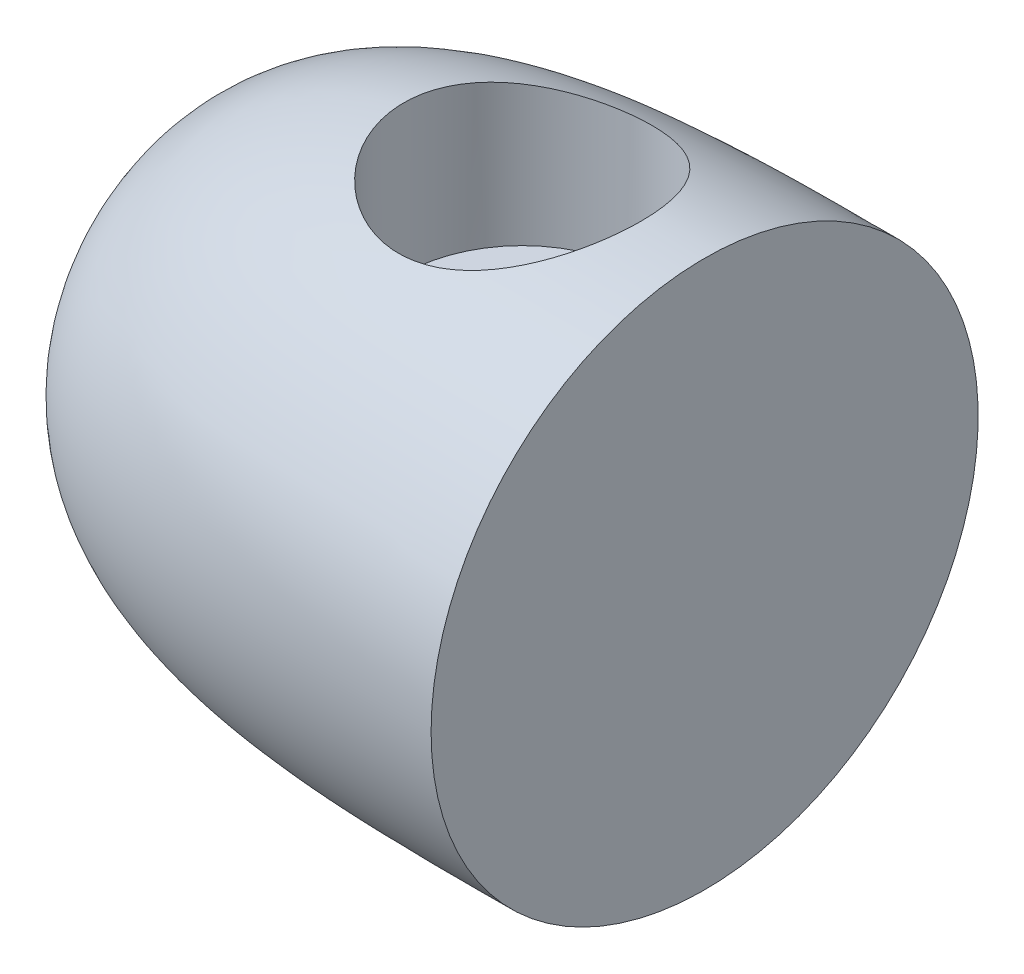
from build123d import *

# Parameters (mm, degrees)
SKETCH3_R          = 8.255
CUT_EXTRUDE2_DEPTH = 51.258209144
SKETCH4_R          = 12.397062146
CUT_EXTRUDE3_DEPTH = 10


with BuildPart() as part:
    # Sketch1 → Revolve1 (revolve)
    with BuildSketch(Plane.XY):
        with BuildLine():
            Line((-38.1, 0), (0, 0))
            Line((0, 0), (0, 19.05))
            add(Edge.make_bspline(
                [(-38.1, 0), (-38.1, 19.511634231), (-17.237160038, 19.05), (0, 19.05)],
                knots=[0, 0, 0, 0, 1, 1, 1, 1], degree=3))
        make_face()
    revolve(axis=Axis((-71.948497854, 0, 0), (1, 0, 0)))

    # Sketch3 → Cut-Extrude2 (cut, through all)
    with BuildSketch(Plane(origin=(0, 7.62, 0), x_dir=(1, 0, 0), z_dir=(0, 1, 0))):
        with Locations((-12.7, 0)):
            Circle(SKETCH3_R)
    extrude(amount=CUT_EXTRUDE2_DEPTH, mode=Mode.SUBTRACT)

    # Sketch4 → Cut-Extrude3 (cut)
    with BuildSketch(Plane(origin=(-37, 0, 0), x_dir=(0, 0, -1), z_dir=(1, 0, 0))):
        Circle(SKETCH4_R)
    extrude(amount=-CUT_EXTRUDE3_DEPTH, mode=Mode.SUBTRACT)


solid = part.part
